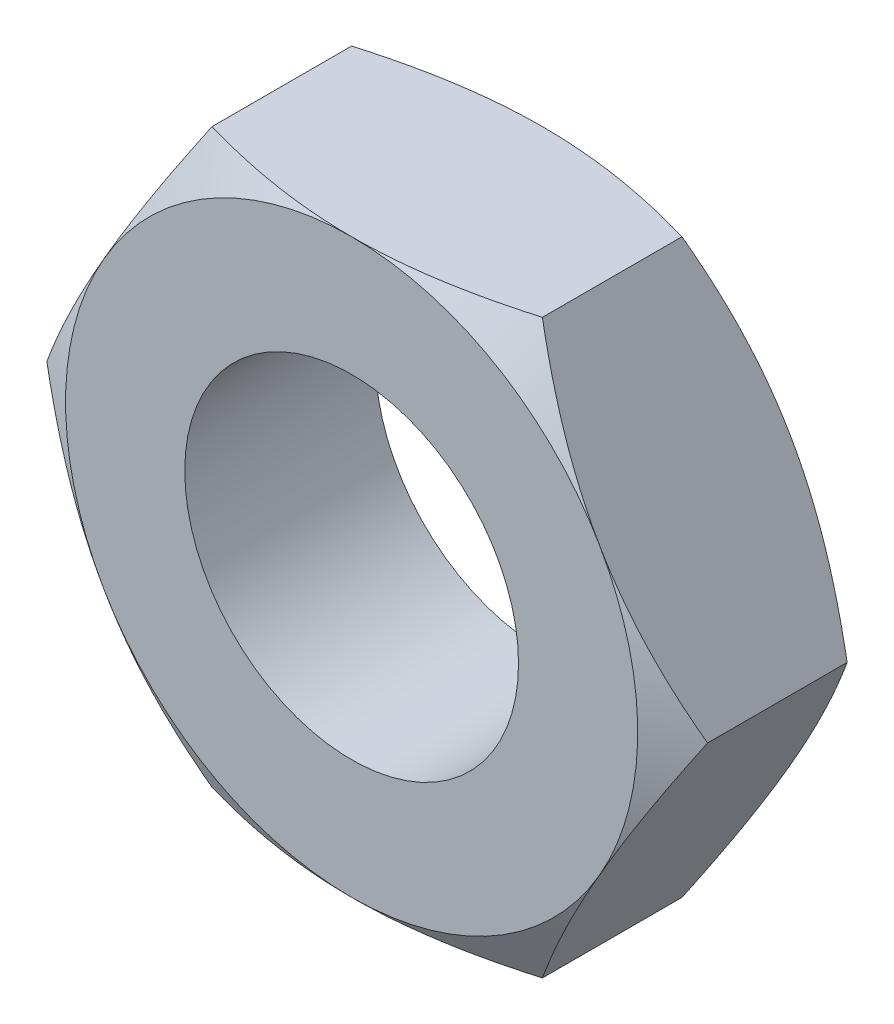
from build123d import *

# Parameters (mm, degrees)
EXTRUDE1_DEPTH = 5
TAPPED_HOLE1_D = 17.5


with BuildPart() as part:
    # Sketch1 → Extrude1 (new, symmetric)
    with BuildSketch(Plane.XY):
        Polygon((8.660254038, 15), (-8.660254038, 15), (-17.320508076, 0), (-8.660254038, -15), (8.660254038, -15), (17.320508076, 0), align=None)
    extrude(amount=EXTRUDE1_DEPTH, both=True)

    # Sketch2 → Cut-Revolve1 (revolve, cut)
    with BuildSketch(Plane(origin=(0, 0, 0), x_dir=(0, 0, -1), z_dir=(1, 0, 0))):
        Polygon((-5, 15), (-5, 30), (3.660254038, 30), align=None)
    cut_revolve1 = revolve(axis=Axis((0, 0, 0), (0, 0, -1)), mode=Mode.SUBTRACT)

    # Mirror1: Cut-Revolve1 across plane
    add(cut_revolve1.mirror(Plane.XY), mode=Mode.SUBTRACT)

    # Tapped Hole1 (through all)
    with Locations(Plane.XY.offset(5)):
        with Locations((0, 0)):
            Hole(TAPPED_HOLE1_D / 2)


solid = part.part
